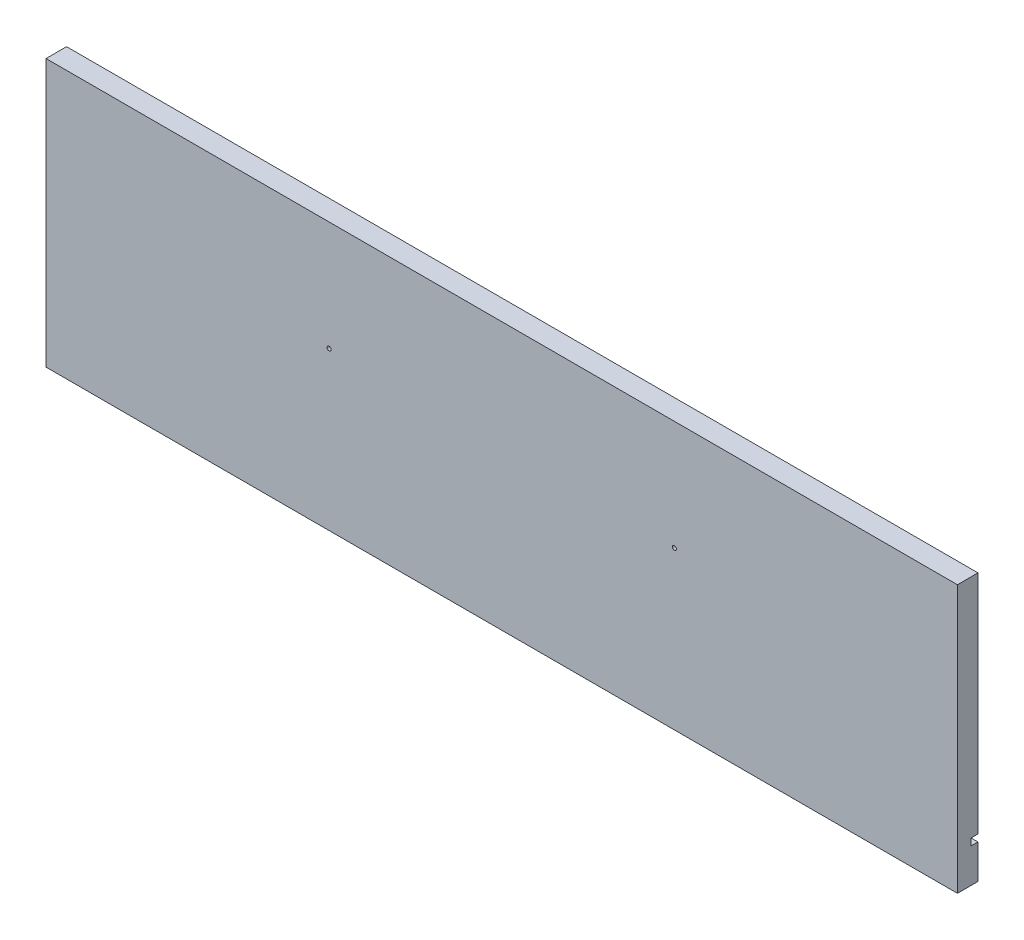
from build123d import *

# Parameters (mm, degrees)
SKETCH1_W                          = 665
SKETCH1_H                          = 195
BASE_EXTRUDE_DEPTH                 = 15
SKETCH2_W                          = 5
SKETCH2_H                          = 5
CUT_EXTRUDE1_DEPTH                 = 694.163039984
M3_0_3_000000_DIAMETER_HOLE1_D     = 3
M3_0_3_000000_DIAMETER_HOLE2_D     = 3
M3_0_3_000000_DIAMETER_HOLE2_DEPTH = 10
M3_0_3_000000_DIAMETER_HOLE2_TIP   = 0.901290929


with BuildPart() as part:
    # Sketch1 → Base-Extrude (new body)
    with BuildSketch(Plane.XY):
        with Locations((0, 97.5)):
            Rectangle(SKETCH1_W, SKETCH1_H)
    extrude(amount=-BASE_EXTRUDE_DEPTH)

    # Sketch2 → Cut-Extrude1 (cut, through all)
    with BuildSketch(Plane(origin=(332.5, 0, 0), x_dir=(0, 0, -1), z_dir=(1, 0, 0))):
        with Locations((12.5, 27.5)):
            Rectangle(SKETCH2_W, SKETCH2_H)
    extrude(amount=-CUT_EXTRUDE1_DEPTH, mode=Mode.SUBTRACT)

    # M3.0 _3.000000_ Diameter Hole1 (through all)
    with Locations(Plane.XY):
        with Locations((-126, 115), (126, 115)):
            Hole(M3_0_3_000000_DIAMETER_HOLE1_D / 2)

    # M3.0 _3.000000_ Diameter Hole2
    with Locations(Plane(origin=(0, 0, -15), x_dir=(-1, 0, 0), z_dir=(0, 0, -1))):
        with Locations((-325, 135), (-325, 45), (325, 135), (325, 45)):
            Hole(M3_0_3_000000_DIAMETER_HOLE2_D / 2, depth=M3_0_3_000000_DIAMETER_HOLE2_DEPTH)
            with Locations((0, 0, -(M3_0_3_000000_DIAMETER_HOLE2_DEPTH + M3_0_3_000000_DIAMETER_HOLE2_TIP / 2))):  # 118° drill point
                Cone(0, M3_0_3_000000_DIAMETER_HOLE2_D / 2, M3_0_3_000000_DIAMETER_HOLE2_TIP, mode=Mode.SUBTRACT)


solid = part.part
